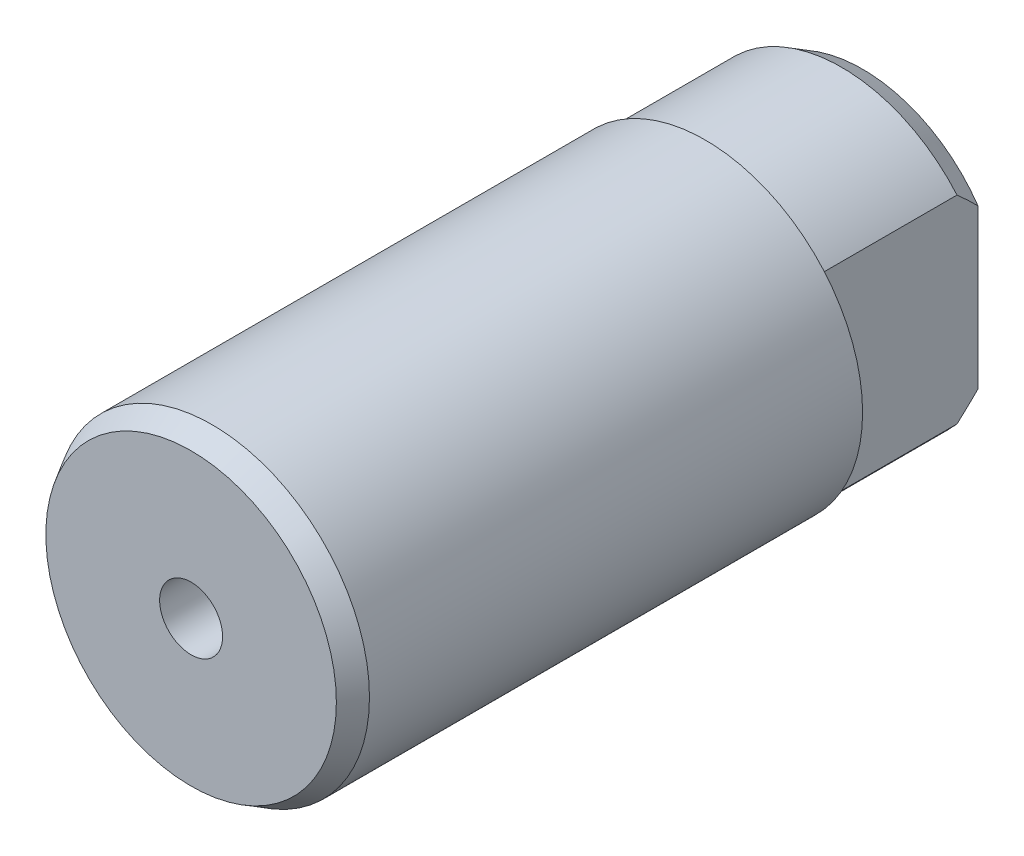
ISO-10303-21;
HEADER;
FILE_DESCRIPTION(('STEP AP214'),'2;1');
FILE_NAME('part.step','',(''),(''),'','','');
FILE_SCHEMA(('AUTOMOTIVE_DESIGN { 1 0 10303 214 1 1 1 1 }'));
ENDSEC;
DATA;
#1=APPLICATION_CONTEXT('core data for automotive mechanical design processes');
#2=APPLICATION_PROTOCOL_DEFINITION('international standard','automotive_design',2000,#1);
#3=PRODUCT_CONTEXT('',#1,'mechanical');
#4=PRODUCT('Part','Part','',(#3));
#5=PRODUCT_RELATED_PRODUCT_CATEGORY('part','',(#4));
#6=PRODUCT_DEFINITION_FORMATION('','',#4);
#7=PRODUCT_DEFINITION_CONTEXT('part definition',#1,'design');
#8=PRODUCT_DEFINITION('design','',#6,#7);
#9=PRODUCT_DEFINITION_SHAPE('','',#8);
#10=(LENGTH_UNIT() NAMED_UNIT(*) SI_UNIT(.MILLI.,.METRE.));
#11=(NAMED_UNIT(*) PLANE_ANGLE_UNIT() SI_UNIT($,.RADIAN.));
#12=(NAMED_UNIT(*) SI_UNIT($,.STERADIAN.) SOLID_ANGLE_UNIT());
#13=UNCERTAINTY_MEASURE_WITH_UNIT(LENGTH_MEASURE(1.E-05),#10,'distance_accuracy_value','');
#14=(GEOMETRIC_REPRESENTATION_CONTEXT(3) GLOBAL_UNCERTAINTY_ASSIGNED_CONTEXT((#13)) GLOBAL_UNIT_ASSIGNED_CONTEXT((#10,
#11,#12)) REPRESENTATION_CONTEXT('',''));
#15=CARTESIAN_POINT('',(0.,0.,0.));
#16=DIRECTION('',(0.,0.,1.));
#17=DIRECTION('',(1.,0.,0.));
#18=AXIS2_PLACEMENT_3D('',#15,#16,#17);
#19=CARTESIAN_POINT('',(0.,0.,-13.));
#20=DIRECTION('',(0.,0.,1.));
#21=DIRECTION('',(1.,0.,0.));
#22=AXIS2_PLACEMENT_3D('',#19,#20,#21);
#23=CONICAL_SURFACE('',#22,14.5,0.523598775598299);
#24=CARTESIAN_POINT('',(-11.,-5.44172254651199,-16.858278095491));
#25=CARTESIAN_POINT('',(-11.,-5.63047692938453,-16.7132623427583));
#26=CARTESIAN_POINT('',(-11.,-5.81631487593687,-16.5645273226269));
#27=CARTESIAN_POINT('',(-11.,-6.18265353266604,-16.2607328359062));
#28=CARTESIAN_POINT('',(-11.,-6.36315597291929,-16.1056754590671));
#29=CARTESIAN_POINT('',(-11.,-6.71905488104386,-15.7905968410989));
#30=CARTESIAN_POINT('',(-11.,-6.89446159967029,-15.6305871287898));
#31=CARTESIAN_POINT('',(-11.,-7.24107263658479,-15.3060614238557));
#32=CARTESIAN_POINT('',(-11.,-7.41227657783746,-15.1415450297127));
#33=CARTESIAN_POINT('',(-11.,-7.91998740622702,-14.6425175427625));
#34=CARTESIAN_POINT('',(-11.,-8.25087483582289,-14.302275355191));
#35=CARTESIAN_POINT('',(-11.,-8.73842819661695,-13.7830436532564));
#36=CARTESIAN_POINT('',(-11.,-8.89966133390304,-13.608284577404));
#37=CARTESIAN_POINT('',(-11.,-9.21935004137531,-13.2562648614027));
#38=CARTESIAN_POINT('',(-11.,-9.37780580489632,-13.0790043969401));
#39=CARTESIAN_POINT('',(-11.,-9.53502702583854,-12.900648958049));
#40=B_SPLINE_CURVE_WITH_KNOTS('',3,(#24,#25,#26,#27,#28,#29,#30,#31,#32,#33,#34,#35,#36,#37,#38,
#39),.UNSPECIFIED.,.F.,.F.,(4,2,2,2,2,2,2,4),(0.,0.713971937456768,1.42770976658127,
2.13989535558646,2.85214460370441,4.27550911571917,4.98881533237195,5.70207169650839),.UNSPECIFIED.);
#41=CARTESIAN_POINT('',(-11.,-7.55625685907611,-15.));
#42=VERTEX_POINT('',#41);
#43=CARTESIAN_POINT('',(-11.,-9.44722181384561,-13.));
#44=VERTEX_POINT('',#43);
#45=EDGE_CURVE('E29',#42,#44,#40,.T.);
#46=ORIENTED_EDGE('',*,*,#45,.F.);
#47=CARTESIAN_POINT('',(0.,0.,-15.));
#48=DIRECTION('',(0.,0.,1.));
#49=DIRECTION('',(1.,0.,0.));
#50=AXIS2_PLACEMENT_3D('',#47,#48,#49);
#51=CIRCLE('',#50,13.3452994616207);
#52=CARTESIAN_POINT('',(11.,-7.55625685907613,-15.));
#53=VERTEX_POINT('',#52);
#54=EDGE_CURVE('E99',#42,#53,#51,.T.);
#55=ORIENTED_EDGE('',*,*,#54,.T.);
#56=CARTESIAN_POINT('',(11.,-5.44172223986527,-16.8582783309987));
#57=CARTESIAN_POINT('',(11.,-5.63047664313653,-16.7132625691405));
#58=CARTESIAN_POINT('',(11.,-5.81631460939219,-16.5645275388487));
#59=CARTESIAN_POINT('',(11.,-6.18265330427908,-16.2607330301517));
#60=CARTESIAN_POINT('',(11.,-6.3631557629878,-16.105675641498));
#61=CARTESIAN_POINT('',(11.,-6.71905470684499,-15.7905969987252));
#62=CARTESIAN_POINT('',(11.,-6.89446144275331,-15.6305872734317));
#63=CARTESIAN_POINT('',(11.,-7.24107251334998,-15.3060615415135));
#64=CARTESIAN_POINT('',(11.,-7.41227647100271,-15.1415451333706));
#65=CARTESIAN_POINT('',(11.,-7.9199873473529,-14.6425176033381));
#66=CARTESIAN_POINT('',(11.,-8.25087480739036,-14.3022753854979));
#67=CARTESIAN_POINT('',(11.,-8.73842821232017,-13.7830436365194));
#68=CARTESIAN_POINT('',(11.,-8.89966136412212,-13.6082845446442));
#69=CARTESIAN_POINT('',(11.,-9.21935010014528,-13.2562647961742));
#70=CARTESIAN_POINT('',(11.,-9.37780587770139,-13.0790043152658));
#71=CARTESIAN_POINT('',(11.,-9.53502711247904,-12.9006488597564));
#72=B_SPLINE_CURVE_WITH_KNOTS('',3,(#56,#57,#58,#59,#60,#61,#62,#63,#64,#65,#66,#67,#68,#69,#70,
#71),.UNSPECIFIED.,.F.,.F.,(4,2,2,2,2,2,2,4),(0.,0.713972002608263,1.42770989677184,
2.139895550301,2.85214486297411,4.27550950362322,4.98881578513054,5.70207221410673),.UNSPECIFIED.);
#73=CARTESIAN_POINT('',(11.,-9.44722181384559,-13.));
#74=VERTEX_POINT('',#73);
#75=EDGE_CURVE('E86',#53,#74,#72,.T.);
#76=ORIENTED_EDGE('',*,*,#75,.T.);
#77=CARTESIAN_POINT('',(0.,0.,-13.));
#78=DIRECTION('',(0.,0.,1.));
#79=DIRECTION('',(1.,0.,0.));
#80=AXIS2_PLACEMENT_3D('',#77,#78,#79);
#81=CIRCLE('',#80,14.5);
#82=EDGE_CURVE('E84',#44,#74,#81,.T.);
#83=ORIENTED_EDGE('',*,*,#82,.F.);
#84=EDGE_LOOP('',(#46,#55,#76,#83));
#85=FACE_BOUND('',#84,.T.);
#86=ADVANCED_FACE('F14',(#85),#23,.T.);
#87=CARTESIAN_POINT('',(0.,0.,85.));
#88=DIRECTION('',(0.,0.,1.));
#89=DIRECTION('',(1.,0.,0.));
#90=AXIS2_PLACEMENT_3D('',#87,#88,#89);
#91=CYLINDRICAL_SURFACE('',#90,14.5);
#92=DIRECTION('',(0.,0.,1.));
#93=VECTOR('',#92,1.);
#94=CARTESIAN_POINT('',(-11.,9.44722181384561,85.));
#95=LINE('',#94,#93);
#96=CARTESIAN_POINT('',(-11.,9.44722181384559,0.));
#97=VERTEX_POINT('',#96);
#98=CARTESIAN_POINT('',(-11.,9.44722181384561,-13.));
#99=VERTEX_POINT('',#98);
#100=EDGE_CURVE('E152',#97,#99,#95,.F.);
#101=ORIENTED_EDGE('',*,*,#100,.F.);
#102=CARTESIAN_POINT('',(0.,0.,0.));
#103=DIRECTION('',(0.,0.,1.));
#104=DIRECTION('',(1.,0.,0.));
#105=AXIS2_PLACEMENT_3D('',#102,#103,#104);
#106=CIRCLE('',#105,14.5);
#107=CARTESIAN_POINT('',(11.,9.44722181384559,0.));
#108=VERTEX_POINT('',#107);
#109=EDGE_CURVE('E77',#108,#97,#106,.T.);
#110=ORIENTED_EDGE('',*,*,#109,.F.);
#111=DIRECTION('',(0.,0.,1.));
#112=VECTOR('',#111,1.);
#113=CARTESIAN_POINT('',(11.,9.44722181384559,85.));
#114=LINE('',#113,#112);
#115=CARTESIAN_POINT('',(11.,9.44722181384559,-13.));
#116=VERTEX_POINT('',#115);
#117=EDGE_CURVE('E9',#108,#116,#114,.F.);
#118=ORIENTED_EDGE('',*,*,#117,.T.);
#119=EDGE_CURVE('E96',#116,#99,#81,.T.);
#120=ORIENTED_EDGE('',*,*,#119,.T.);
#121=EDGE_LOOP('',(#101,#110,#118,#120));
#122=FACE_BOUND('',#121,.T.);
#123=ADVANCED_FACE('F130',(#122),#91,.T.);
#124=CARTESIAN_POINT('',(13.3452994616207,0.,-15.));
#125=DIRECTION('',(0.,0.,-1.));
#126=DIRECTION('',(-1.,0.,0.));
#127=AXIS2_PLACEMENT_3D('',#124,#125,#126);
#128=PLANE('',#127);
#129=DIRECTION('',(0.,1.,0.));
#130=VECTOR('',#129,1.);
#131=CARTESIAN_POINT('',(-11.,-20.,-15.));
#132=LINE('',#131,#130);
#133=CARTESIAN_POINT('',(-11.,7.55625685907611,-15.));
#134=VERTEX_POINT('',#133);
#135=EDGE_CURVE('E72',#42,#134,#132,.T.);
#136=ORIENTED_EDGE('',*,*,#135,.T.);
#137=CARTESIAN_POINT('',(11.,7.55625685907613,-15.));
#138=VERTEX_POINT('',#137);
#139=EDGE_CURVE('E100',#138,#134,#51,.T.);
#140=ORIENTED_EDGE('',*,*,#139,.F.);
#141=DIRECTION('',(0.,1.,0.));
#142=VECTOR('',#141,1.);
#143=CARTESIAN_POINT('',(11.,-20.,-15.));
#144=LINE('',#143,#142);
#145=EDGE_CURVE('E151',#53,#138,#144,.T.);
#146=ORIENTED_EDGE('',*,*,#145,.F.);
#147=ORIENTED_EDGE('',*,*,#54,.F.);
#148=EDGE_LOOP('',(#136,#140,#146,#147));
#149=FACE_BOUND('',#148,.T.);
#150=ADVANCED_FACE('F136',(#149),#128,.T.);
#151=CARTESIAN_POINT('',(-11.,9.53502717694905,-12.9006487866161));
#152=CARTESIAN_POINT('',(-11.,9.37780595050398,-13.079004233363));
#153=CARTESIAN_POINT('',(-11.,9.21935018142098,-13.2562647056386));
#154=CARTESIAN_POINT('',(-11.,8.89966146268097,-13.6082844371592));
#155=CARTESIAN_POINT('',(-11.,8.73842831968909,-13.7830435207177));
#156=CARTESIAN_POINT('',(-11.,8.25087494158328,-14.3022752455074));
#157=CARTESIAN_POINT('',(-11.,7.91998750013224,-14.6425174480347));
#158=CARTESIAN_POINT('',(-11.,7.41227665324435,-15.1415449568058));
#159=CARTESIAN_POINT('',(-11.,7.24107270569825,-15.3060613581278));
#160=CARTESIAN_POINT('',(-11.,6.8944616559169,-15.6305870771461));
#161=CARTESIAN_POINT('',(-11.,6.7190549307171,-15.7905967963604));
#162=CARTESIAN_POINT('',(-11.,6.36315600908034,-16.1056754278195));
#163=CARTESIAN_POINT('',(-11.,6.18265356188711,-16.2607328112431));
#164=CARTESIAN_POINT('',(-11.,5.81631489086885,-16.5645273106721));
#165=CARTESIAN_POINT('',(-11.,5.63047693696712,-16.713262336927));
#166=CARTESIAN_POINT('',(-11.,5.44172254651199,-16.858278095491));
#167=B_SPLINE_CURVE_WITH_KNOTS('',3,(#151,#152,#153,#154,#155,#156,#157,#158,#159,#160,#161,
#162,#163,#164,#165,#166),.UNSPECIFIED.,.F.,.F.,(4,2,2,2,2,2,2,4),(0.,0.71325639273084,
1.42656263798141,2.84992720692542,3.56217648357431,4.27436210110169,4.98809995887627,
5.70207192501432),.UNSPECIFIED.);
#168=EDGE_CURVE('E148',#99,#134,#167,.T.);
#169=ORIENTED_EDGE('',*,*,#168,.F.);
#170=ORIENTED_EDGE('',*,*,#119,.F.);
#171=CARTESIAN_POINT('',(11.,9.53502711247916,-12.9006488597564));
#172=CARTESIAN_POINT('',(11.,9.37780587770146,-13.0790043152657));
#173=CARTESIAN_POINT('',(11.,9.21935010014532,-13.2562647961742));
#174=CARTESIAN_POINT('',(11.,8.89966136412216,-13.6082845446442));
#175=CARTESIAN_POINT('',(11.,8.7384282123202,-13.7830436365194));
#176=CARTESIAN_POINT('',(11.,8.25087480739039,-14.3022753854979));
#177=CARTESIAN_POINT('',(11.,7.91998734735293,-14.642517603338));
#178=CARTESIAN_POINT('',(11.,7.41227647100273,-15.1415451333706));
#179=CARTESIAN_POINT('',(11.,7.24107251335,-15.3060615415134));
#180=CARTESIAN_POINT('',(11.,6.89446144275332,-15.6305872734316));
#181=CARTESIAN_POINT('',(11.,6.71905470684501,-15.7905969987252));
#182=CARTESIAN_POINT('',(11.,6.36315576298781,-16.1056756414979));
#183=CARTESIAN_POINT('',(11.,6.18265330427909,-16.2607330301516));
#184=CARTESIAN_POINT('',(11.,5.81631460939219,-16.5645275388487));
#185=CARTESIAN_POINT('',(11.,5.63047664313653,-16.7132625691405));
#186=CARTESIAN_POINT('',(11.,5.44172223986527,-16.8582783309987));
#187=B_SPLINE_CURVE_WITH_KNOTS('',3,(#171,#172,#173,#174,#175,#176,#177,#178,#179,#180,#181,
#182,#183,#184,#185,#186),.UNSPECIFIED.,.F.,.F.,(4,2,2,2,2,2,2,4),(0.,0.713256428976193,
1.42656271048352,2.84992735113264,3.56217666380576,4.27436231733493,4.98810021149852,
5.70207221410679),.UNSPECIFIED.);
#188=EDGE_CURVE('E82',#116,#138,#187,.T.);
#189=ORIENTED_EDGE('',*,*,#188,.T.);
#190=ORIENTED_EDGE('',*,*,#139,.T.);
#191=EDGE_LOOP('',(#169,#170,#189,#190));
#192=FACE_BOUND('',#191,.T.);
#193=ADVANCED_FACE('F128',(#192),#23,.T.);
#194=DIRECTION('',(0.,0.,1.));
#195=VECTOR('',#194,1.);
#196=CARTESIAN_POINT('',(-11.,-9.44722181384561,85.));
#197=LINE('',#196,#195);
#198=CARTESIAN_POINT('',(-11.,-9.44722181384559,0.));
#199=VERTEX_POINT('',#198);
#200=EDGE_CURVE('E66',#44,#199,#197,.T.);
#201=ORIENTED_EDGE('',*,*,#200,.F.);
#202=ORIENTED_EDGE('',*,*,#82,.T.);
#203=DIRECTION('',(0.,0.,1.));
#204=VECTOR('',#203,1.);
#205=CARTESIAN_POINT('',(11.,-9.44722181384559,85.));
#206=LINE('',#205,#204);
#207=CARTESIAN_POINT('',(11.,-9.44722181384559,0.));
#208=VERTEX_POINT('',#207);
#209=EDGE_CURVE('E22',#74,#208,#206,.T.);
#210=ORIENTED_EDGE('',*,*,#209,.T.);
#211=EDGE_CURVE('E37',#199,#208,#106,.T.);
#212=ORIENTED_EDGE('',*,*,#211,.F.);
#213=EDGE_LOOP('',(#201,#202,#210,#212));
#214=FACE_BOUND('',#213,.T.);
#215=ADVANCED_FACE('F80',(#214),#91,.T.);
#216=CARTESIAN_POINT('',(15.,0.,0.));
#217=DIRECTION('',(0.,0.,-1.));
#218=DIRECTION('',(-1.,0.,0.));
#219=AXIS2_PLACEMENT_3D('',#216,#217,#218);
#220=PLANE('',#219);
#221=ORIENTED_EDGE('',*,*,#109,.T.);
#222=DIRECTION('',(0.,1.,0.));
#223=VECTOR('',#222,1.);
#224=CARTESIAN_POINT('',(-11.,-20.,0.));
#225=LINE('',#224,#223);
#226=EDGE_CURVE('E68',#199,#97,#225,.T.);
#227=ORIENTED_EDGE('',*,*,#226,.F.);
#228=ORIENTED_EDGE('',*,*,#211,.T.);
#229=DIRECTION('',(0.,1.,0.));
#230=VECTOR('',#229,1.);
#231=CARTESIAN_POINT('',(11.,-20.,0.));
#232=LINE('',#231,#230);
#233=EDGE_CURVE('E156',#208,#108,#232,.T.);
#234=ORIENTED_EDGE('',*,*,#233,.T.);
#235=EDGE_LOOP('',(#221,#227,#228,#234));
#236=FACE_BOUND('',#235,.T.);
#237=CARTESIAN_POINT('',(0.,0.,0.));
#238=DIRECTION('',(0.,0.,1.));
#239=DIRECTION('',(1.,0.,0.));
#240=AXIS2_PLACEMENT_3D('',#237,#238,#239);
#241=CIRCLE('',#240,15.);
#242=CARTESIAN_POINT('',(15.,0.,0.));
#243=VERTEX_POINT('',#242);
#244=EDGE_CURVE('E115',#243,#243,#241,.T.);
#245=ORIENTED_EDGE('',*,*,#244,.F.);
#246=EDGE_LOOP('',(#245));
#247=FACE_BOUND('',#246,.T.);
#248=ADVANCED_FACE('F16',(#236,#247),#220,.T.);
#249=CARTESIAN_POINT('',(0.,0.,85.));
#250=DIRECTION('',(0.,0.,1.));
#251=DIRECTION('',(1.,0.,0.));
#252=AXIS2_PLACEMENT_3D('',#249,#250,#251);
#253=CYLINDRICAL_SURFACE('',#252,15.);
#254=ORIENTED_EDGE('',*,*,#244,.T.);
#255=EDGE_LOOP('',(#254));
#256=FACE_BOUND('',#255,.T.);
#257=CARTESIAN_POINT('',(0.,0.,47.));
#258=DIRECTION('',(0.,0.,1.));
#259=DIRECTION('',(1.,0.,0.));
#260=AXIS2_PLACEMENT_3D('',#257,#258,#259);
#261=CIRCLE('',#260,15.);
#262=CARTESIAN_POINT('',(15.,0.,47.));
#263=VERTEX_POINT('',#262);
#264=EDGE_CURVE('E112',#263,#263,#261,.T.);
#265=ORIENTED_EDGE('',*,*,#264,.F.);
#266=EDGE_LOOP('',(#265));
#267=FACE_BOUND('',#266,.T.);
#268=ADVANCED_FACE('F119',(#256,#267),#253,.T.);
#269=CARTESIAN_POINT('',(0.,0.,47.));
#270=DIRECTION('',(0.,0.,-1.));
#271=DIRECTION('',(-1.,0.,0.));
#272=AXIS2_PLACEMENT_3D('',#269,#270,#271);
#273=CONICAL_SURFACE('',#272,15.,0.523598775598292);
#274=CARTESIAN_POINT('',(0.,0.,49.));
#275=DIRECTION('',(0.,0.,1.));
#276=DIRECTION('',(1.,0.,0.));
#277=AXIS2_PLACEMENT_3D('',#274,#275,#276);
#278=CIRCLE('',#277,13.8452994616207);
#279=CARTESIAN_POINT('',(13.8452994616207,0.,49.));
#280=VERTEX_POINT('',#279);
#281=EDGE_CURVE('E109',#280,#280,#278,.T.);
#282=ORIENTED_EDGE('',*,*,#281,.F.);
#283=EDGE_LOOP('',(#282));
#284=FACE_BOUND('',#283,.T.);
#285=ORIENTED_EDGE('',*,*,#264,.T.);
#286=EDGE_LOOP('',(#285));
#287=FACE_BOUND('',#286,.T.);
#288=ADVANCED_FACE('F127',(#284,#287),#273,.T.);
#289=CARTESIAN_POINT('',(3.,0.,49.));
#290=DIRECTION('',(0.,0.,1.));
#291=DIRECTION('',(1.,0.,0.));
#292=AXIS2_PLACEMENT_3D('',#289,#290,#291);
#293=PLANE('',#292);
#294=ORIENTED_EDGE('',*,*,#281,.T.);
#295=EDGE_LOOP('',(#294));
#296=FACE_BOUND('',#295,.T.);
#297=CARTESIAN_POINT('',(0.,0.,49.));
#298=DIRECTION('',(0.,0.,1.));
#299=DIRECTION('',(1.,0.,0.));
#300=AXIS2_PLACEMENT_3D('',#297,#298,#299);
#301=CIRCLE('',#300,3.);
#302=CARTESIAN_POINT('',(3.,0.,49.));
#303=VERTEX_POINT('',#302);
#304=EDGE_CURVE('E106',#303,#303,#301,.T.);
#305=ORIENTED_EDGE('',*,*,#304,.F.);
#306=EDGE_LOOP('',(#305));
#307=FACE_BOUND('',#306,.T.);
#308=ADVANCED_FACE('F211',(#296,#307),#293,.T.);
#309=CARTESIAN_POINT('',(0.,0.,85.));
#310=DIRECTION('',(0.,0.,1.));
#311=DIRECTION('',(1.,0.,0.));
#312=AXIS2_PLACEMENT_3D('',#309,#310,#311);
#313=CYLINDRICAL_SURFACE('',#312,3.);
#314=ORIENTED_EDGE('',*,*,#304,.T.);
#315=EDGE_LOOP('',(#314));
#316=FACE_BOUND('',#315,.T.);
#317=CARTESIAN_POINT('',(0.,0.,39.));
#318=DIRECTION('',(0.,0.,1.));
#319=DIRECTION('',(1.,0.,0.));
#320=AXIS2_PLACEMENT_3D('',#317,#318,#319);
#321=CIRCLE('',#320,3.);
#322=CARTESIAN_POINT('',(3.,0.,39.));
#323=VERTEX_POINT('',#322);
#324=EDGE_CURVE('E103',#323,#323,#321,.T.);
#325=ORIENTED_EDGE('',*,*,#324,.F.);
#326=EDGE_LOOP('',(#325));
#327=FACE_BOUND('',#326,.T.);
#328=ADVANCED_FACE('F202',(#316,#327),#313,.F.);
#329=CARTESIAN_POINT('',(0.,0.,39.));
#330=DIRECTION('',(0.,0.,1.));
#331=DIRECTION('',(1.,0.,0.));
#332=AXIS2_PLACEMENT_3D('',#329,#330,#331);
#333=PLANE('',#332);
#334=ORIENTED_EDGE('',*,*,#324,.T.);
#335=EDGE_LOOP('',(#334));
#336=FACE_BOUND('',#335,.T.);
#337=ADVANCED_FACE('F167',(#336),#333,.T.);
#338=CARTESIAN_POINT('',(11.,-20.,0.));
#339=DIRECTION('',(1.,0.,0.));
#340=DIRECTION('',(0.,0.,-1.));
#341=AXIS2_PLACEMENT_3D('',#338,#339,#340);
#342=PLANE('',#341);
#343=ORIENTED_EDGE('',*,*,#117,.F.);
#344=ORIENTED_EDGE('',*,*,#233,.F.);
#345=ORIENTED_EDGE('',*,*,#209,.F.);
#346=ORIENTED_EDGE('',*,*,#75,.F.);
#347=ORIENTED_EDGE('',*,*,#145,.T.);
#348=ORIENTED_EDGE('',*,*,#188,.F.);
#349=EDGE_LOOP('',(#343,#344,#345,#346,#347,#348));
#350=FACE_BOUND('',#349,.T.);
#351=ADVANCED_FACE('F155',(#350),#342,.T.);
#352=CARTESIAN_POINT('',(-11.,-20.,0.));
#353=DIRECTION('',(1.,0.,0.));
#354=DIRECTION('',(0.,0.,-1.));
#355=AXIS2_PLACEMENT_3D('',#352,#353,#354);
#356=PLANE('',#355);
#357=ORIENTED_EDGE('',*,*,#168,.T.);
#358=ORIENTED_EDGE('',*,*,#135,.F.);
#359=ORIENTED_EDGE('',*,*,#45,.T.);
#360=ORIENTED_EDGE('',*,*,#200,.T.);
#361=ORIENTED_EDGE('',*,*,#226,.T.);
#362=ORIENTED_EDGE('',*,*,#100,.T.);
#363=EDGE_LOOP('',(#357,#358,#359,#360,#361,#362));
#364=FACE_BOUND('',#363,.T.);
#365=ADVANCED_FACE('F67',(#364),#356,.F.);
#366=CLOSED_SHELL('',(#86,#123,#150,#193,#215,#248,#268,#288,#308,#328,#337,#351,#365));
#367=MANIFOLD_SOLID_BREP('B1',#366);
#368=ADVANCED_BREP_SHAPE_REPRESENTATION('',(#18,#367),#14);
#369=SHAPE_DEFINITION_REPRESENTATION(#9,#368);
ENDSEC;
END-ISO-10303-21;
